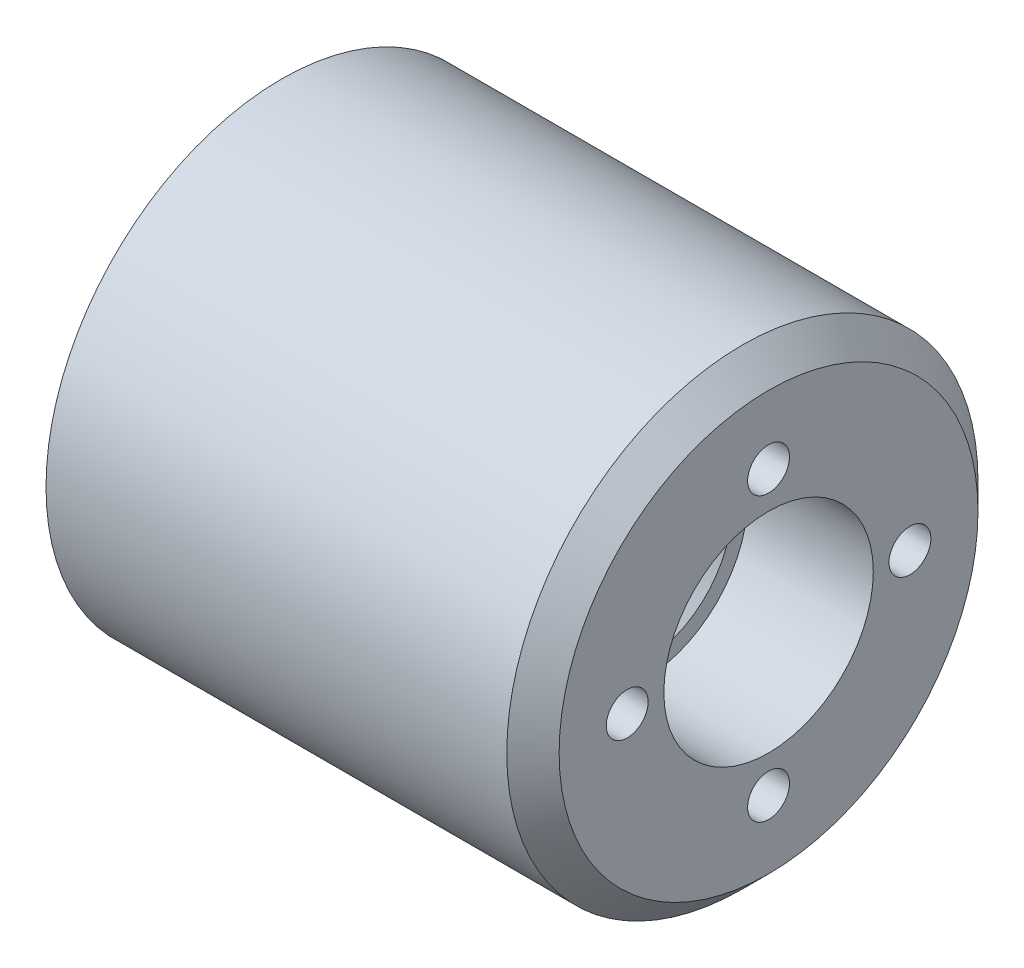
ISO-10303-21;
HEADER;
FILE_DESCRIPTION(('STEP AP214'),'2;1');
FILE_NAME('part.step','',(''),(''),'','','');
FILE_SCHEMA(('AUTOMOTIVE_DESIGN { 1 0 10303 214 1 1 1 1 }'));
ENDSEC;
DATA;
#1=APPLICATION_CONTEXT('core data for automotive mechanical design processes');
#2=APPLICATION_PROTOCOL_DEFINITION('international standard','automotive_design',2000,#1);
#3=PRODUCT_CONTEXT('',#1,'mechanical');
#4=PRODUCT('Part','Part','',(#3));
#5=PRODUCT_RELATED_PRODUCT_CATEGORY('part','',(#4));
#6=PRODUCT_DEFINITION_FORMATION('','',#4);
#7=PRODUCT_DEFINITION_CONTEXT('part definition',#1,'design');
#8=PRODUCT_DEFINITION('design','',#6,#7);
#9=PRODUCT_DEFINITION_SHAPE('','',#8);
#10=(LENGTH_UNIT() NAMED_UNIT(*) SI_UNIT(.MILLI.,.METRE.));
#11=(NAMED_UNIT(*) PLANE_ANGLE_UNIT() SI_UNIT($,.RADIAN.));
#12=(NAMED_UNIT(*) SI_UNIT($,.STERADIAN.) SOLID_ANGLE_UNIT());
#13=UNCERTAINTY_MEASURE_WITH_UNIT(LENGTH_MEASURE(1.E-05),#10,'distance_accuracy_value','');
#14=(GEOMETRIC_REPRESENTATION_CONTEXT(3) GLOBAL_UNCERTAINTY_ASSIGNED_CONTEXT((#13)) GLOBAL_UNIT_ASSIGNED_CONTEXT((#10,
#11,#12)) REPRESENTATION_CONTEXT('',''));
#15=CARTESIAN_POINT('',(0.,0.,0.));
#16=DIRECTION('',(0.,0.,1.));
#17=DIRECTION('',(1.,0.,0.));
#18=AXIS2_PLACEMENT_3D('',#15,#16,#17);
#19=CARTESIAN_POINT('',(0.,0.,0.));
#20=DIRECTION('',(-1.,0.,0.));
#21=DIRECTION('',(0.,0.,1.));
#22=AXIS2_PLACEMENT_3D('',#19,#20,#21);
#23=CYLINDRICAL_SURFACE('',#22,31.);
#24=CARTESIAN_POINT('',(48.,0.,0.));
#25=DIRECTION('',(-1.,0.,0.));
#26=DIRECTION('',(0.,0.,1.));
#27=AXIS2_PLACEMENT_3D('',#24,#25,#26);
#28=CIRCLE('',#27,31.);
#29=CARTESIAN_POINT('',(48.,0.,31.));
#30=VERTEX_POINT('',#29);
#31=EDGE_CURVE('E47',#30,#30,#28,.T.);
#32=ORIENTED_EDGE('',*,*,#31,.F.);
#33=EDGE_LOOP('',(#32));
#34=FACE_BOUND('',#33,.T.);
#35=CARTESIAN_POINT('',(0.,0.,0.));
#36=DIRECTION('',(-1.,0.,0.));
#37=DIRECTION('',(0.,0.,1.));
#38=AXIS2_PLACEMENT_3D('',#35,#36,#37);
#39=CIRCLE('',#38,31.);
#40=CARTESIAN_POINT('',(0.,0.,31.));
#41=VERTEX_POINT('',#40);
#42=EDGE_CURVE('E68',#41,#41,#39,.T.);
#43=ORIENTED_EDGE('',*,*,#42,.T.);
#44=EDGE_LOOP('',(#43));
#45=FACE_BOUND('',#44,.T.);
#46=ADVANCED_FACE('F28',(#34,#45),#23,.F.);
#47=CARTESIAN_POINT('',(48.,27.,0.));
#48=DIRECTION('',(1.,0.,0.));
#49=DIRECTION('',(0.,0.,-1.));
#50=AXIS2_PLACEMENT_3D('',#47,#48,#49);
#51=PLANE('',#50);
#52=CARTESIAN_POINT('',(48.,0.,0.));
#53=DIRECTION('',(-1.,0.,0.));
#54=DIRECTION('',(0.,0.,1.));
#55=AXIS2_PLACEMENT_3D('',#52,#53,#54);
#56=CIRCLE('',#55,27.);
#57=CARTESIAN_POINT('',(48.,0.,27.));
#58=VERTEX_POINT('',#57);
#59=EDGE_CURVE('E50',#58,#58,#56,.T.);
#60=ORIENTED_EDGE('',*,*,#59,.F.);
#61=EDGE_LOOP('',(#60));
#62=FACE_BOUND('',#61,.T.);
#63=ORIENTED_EDGE('',*,*,#31,.T.);
#64=EDGE_LOOP('',(#63));
#65=FACE_BOUND('',#64,.T.);
#66=ADVANCED_FACE('F166',(#62,#65),#51,.F.);
#67=CARTESIAN_POINT('',(0.,0.,0.));
#68=DIRECTION('',(-1.,0.,0.));
#69=DIRECTION('',(0.,0.,1.));
#70=AXIS2_PLACEMENT_3D('',#67,#68,#69);
#71=CYLINDRICAL_SURFACE('',#70,27.);
#72=CARTESIAN_POINT('',(61.,0.,0.));
#73=DIRECTION('',(-1.,0.,0.));
#74=DIRECTION('',(0.,0.,1.));
#75=AXIS2_PLACEMENT_3D('',#72,#73,#74);
#76=CIRCLE('',#75,27.);
#77=CARTESIAN_POINT('',(61.,0.,27.));
#78=VERTEX_POINT('',#77);
#79=EDGE_CURVE('E53',#78,#78,#76,.T.);
#80=ORIENTED_EDGE('',*,*,#79,.F.);
#81=EDGE_LOOP('',(#80));
#82=FACE_BOUND('',#81,.T.);
#83=ORIENTED_EDGE('',*,*,#59,.T.);
#84=EDGE_LOOP('',(#83));
#85=FACE_BOUND('',#84,.T.);
#86=ADVANCED_FACE('F171',(#82,#85),#71,.F.);
#87=CARTESIAN_POINT('',(61.,13.,0.));
#88=DIRECTION('',(1.,0.,0.));
#89=DIRECTION('',(0.,0.,-1.));
#90=AXIS2_PLACEMENT_3D('',#87,#88,#89);
#91=PLANE('',#90);
#92=CARTESIAN_POINT('',(61.,0.,0.));
#93=DIRECTION('',(-1.,0.,0.));
#94=DIRECTION('',(0.,0.,1.));
#95=AXIS2_PLACEMENT_3D('',#92,#93,#94);
#96=CIRCLE('',#95,13.);
#97=CARTESIAN_POINT('',(61.,0.,13.));
#98=VERTEX_POINT('',#97);
#99=EDGE_CURVE('E56',#98,#98,#96,.T.);
#100=ORIENTED_EDGE('',*,*,#99,.F.);
#101=EDGE_LOOP('',(#100));
#102=FACE_BOUND('',#101,.T.);
#103=ORIENTED_EDGE('',*,*,#79,.T.);
#104=EDGE_LOOP('',(#103));
#105=FACE_BOUND('',#104,.T.);
#106=ADVANCED_FACE('F163',(#102,#105),#91,.F.);
#107=CARTESIAN_POINT('',(0.,0.,0.));
#108=DIRECTION('',(-1.,0.,0.));
#109=DIRECTION('',(0.,0.,1.));
#110=AXIS2_PLACEMENT_3D('',#107,#108,#109);
#111=CYLINDRICAL_SURFACE('',#110,13.);
#112=CARTESIAN_POINT('',(65.,0.,0.));
#113=DIRECTION('',(-1.,0.,0.));
#114=DIRECTION('',(0.,0.,1.));
#115=AXIS2_PLACEMENT_3D('',#112,#113,#114);
#116=CIRCLE('',#115,13.);
#117=CARTESIAN_POINT('',(65.,0.,13.));
#118=VERTEX_POINT('',#117);
#119=EDGE_CURVE('E10',#118,#118,#116,.F.);
#120=ORIENTED_EDGE('',*,*,#119,.T.);
#121=EDGE_LOOP('',(#120));
#122=FACE_BOUND('',#121,.T.);
#123=ORIENTED_EDGE('',*,*,#99,.T.);
#124=EDGE_LOOP('',(#123));
#125=FACE_BOUND('',#124,.T.);
#126=ADVANCED_FACE('F157',(#122,#125),#111,.F.);
#127=CARTESIAN_POINT('',(69.,20.,0.));
#128=DIRECTION('',(-1.,0.,0.));
#129=DIRECTION('',(0.,0.,1.));
#130=AXIS2_PLACEMENT_3D('',#127,#128,#129);
#131=PLANE('',#130);
#132=CARTESIAN_POINT('',(69.,0.,0.));
#133=DIRECTION('',(-1.,0.,0.));
#134=DIRECTION('',(0.,0.,1.));
#135=AXIS2_PLACEMENT_3D('',#132,#133,#134);
#136=CIRCLE('',#135,17.);
#137=CARTESIAN_POINT('',(69.,0.,17.));
#138=VERTEX_POINT('',#137);
#139=EDGE_CURVE('E34',#138,#138,#136,.T.);
#140=ORIENTED_EDGE('',*,*,#139,.T.);
#141=EDGE_LOOP('',(#140));
#142=FACE_BOUND('',#141,.T.);
#143=CARTESIAN_POINT('',(69.,0.,0.));
#144=DIRECTION('',(-1.,0.,0.));
#145=DIRECTION('',(0.,0.,1.));
#146=AXIS2_PLACEMENT_3D('',#143,#144,#145);
#147=CIRCLE('',#146,20.);
#148=CARTESIAN_POINT('',(69.,0.,20.));
#149=VERTEX_POINT('',#148);
#150=EDGE_CURVE('E59',#149,#149,#147,.T.);
#151=ORIENTED_EDGE('',*,*,#150,.F.);
#152=EDGE_LOOP('',(#151));
#153=FACE_BOUND('',#152,.T.);
#154=ADVANCED_FACE('F152',(#142,#153),#131,.F.);
#155=CARTESIAN_POINT('',(0.,0.,0.));
#156=DIRECTION('',(-1.,0.,0.));
#157=DIRECTION('',(0.,0.,1.));
#158=AXIS2_PLACEMENT_3D('',#155,#156,#157);
#159=CYLINDRICAL_SURFACE('',#158,20.);
#160=CARTESIAN_POINT('',(93.,0.,0.));
#161=DIRECTION('',(-1.,0.,0.));
#162=DIRECTION('',(0.,0.,1.));
#163=AXIS2_PLACEMENT_3D('',#160,#161,#162);
#164=CIRCLE('',#163,20.);
#165=CARTESIAN_POINT('',(93.,0.,20.));
#166=VERTEX_POINT('',#165);
#167=EDGE_CURVE('E62',#166,#166,#164,.T.);
#168=ORIENTED_EDGE('',*,*,#167,.F.);
#169=EDGE_LOOP('',(#168));
#170=FACE_BOUND('',#169,.T.);
#171=ORIENTED_EDGE('',*,*,#150,.T.);
#172=EDGE_LOOP('',(#171));
#173=FACE_BOUND('',#172,.T.);
#174=ADVANCED_FACE('F138',(#170,#173),#159,.F.);
#175=CARTESIAN_POINT('',(93.,45.,0.));
#176=DIRECTION('',(-1.,0.,0.));
#177=DIRECTION('',(0.,0.,1.));
#178=AXIS2_PLACEMENT_3D('',#175,#176,#177);
#179=PLANE('',#178);
#180=CARTESIAN_POINT('',(93.,2.8281015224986E-13,-27.));
#181=DIRECTION('',(1.,0.,0.));
#182=DIRECTION('',(0.,-1.,0.));
#183=AXIS2_PLACEMENT_3D('',#180,#181,#182);
#184=CIRCLE('',#183,4.);
#185=CARTESIAN_POINT('',(93.,-3.99999999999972,-27.));
#186=VERTEX_POINT('',#185);
#187=EDGE_CURVE('E128',#186,#186,#184,.T.);
#188=ORIENTED_EDGE('',*,*,#187,.F.);
#189=EDGE_LOOP('',(#188));
#190=FACE_BOUND('',#189,.T.);
#191=CARTESIAN_POINT('',(93.,-27.,-1.88540101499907E-13));
#192=DIRECTION('',(1.,0.,0.));
#193=DIRECTION('',(0.,0.,1.));
#194=AXIS2_PLACEMENT_3D('',#191,#192,#193);
#195=CIRCLE('',#194,4.);
#196=CARTESIAN_POINT('',(93.,-27.,3.99999999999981));
#197=VERTEX_POINT('',#196);
#198=EDGE_CURVE('E122',#197,#197,#195,.T.);
#199=ORIENTED_EDGE('',*,*,#198,.F.);
#200=EDGE_LOOP('',(#199));
#201=FACE_BOUND('',#200,.T.);
#202=CARTESIAN_POINT('',(93.,0.,27.));
#203=DIRECTION('',(1.,0.,0.));
#204=DIRECTION('',(0.,1.,0.));
#205=AXIS2_PLACEMENT_3D('',#202,#203,#204);
#206=CIRCLE('',#205,4.);
#207=CARTESIAN_POINT('',(93.,3.99999999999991,27.));
#208=VERTEX_POINT('',#207);
#209=EDGE_CURVE('E116',#208,#208,#206,.T.);
#210=ORIENTED_EDGE('',*,*,#209,.F.);
#211=EDGE_LOOP('',(#210));
#212=FACE_BOUND('',#211,.T.);
#213=CARTESIAN_POINT('',(93.,27.,0.));
#214=DIRECTION('',(1.,0.,0.));
#215=DIRECTION('',(0.,0.,-1.));
#216=AXIS2_PLACEMENT_3D('',#213,#214,#215);
#217=CIRCLE('',#216,4.);
#218=CARTESIAN_POINT('',(93.,27.,-4.));
#219=VERTEX_POINT('',#218);
#220=EDGE_CURVE('E110',#219,#219,#217,.T.);
#221=ORIENTED_EDGE('',*,*,#220,.F.);
#222=EDGE_LOOP('',(#221));
#223=FACE_BOUND('',#222,.T.);
#224=CARTESIAN_POINT('',(93.,0.,0.));
#225=DIRECTION('',(-1.,0.,0.));
#226=DIRECTION('',(0.,0.,1.));
#227=AXIS2_PLACEMENT_3D('',#224,#225,#226);
#228=CIRCLE('',#227,40.);
#229=CARTESIAN_POINT('',(93.,0.,40.));
#230=VERTEX_POINT('',#229);
#231=EDGE_CURVE('E38',#230,#230,#228,.F.);
#232=ORIENTED_EDGE('',*,*,#231,.T.);
#233=EDGE_LOOP('',(#232));
#234=FACE_BOUND('',#233,.T.);
#235=ORIENTED_EDGE('',*,*,#167,.T.);
#236=EDGE_LOOP('',(#235));
#237=FACE_BOUND('',#236,.T.);
#238=ADVANCED_FACE('F134',(#190,#201,#212,#223,#234,#237),#179,.F.);
#239=CARTESIAN_POINT('',(0.,0.,0.));
#240=DIRECTION('',(-1.,0.,0.));
#241=DIRECTION('',(0.,0.,1.));
#242=AXIS2_PLACEMENT_3D('',#239,#240,#241);
#243=CYLINDRICAL_SURFACE('',#242,45.);
#244=CARTESIAN_POINT('',(88.,0.,0.));
#245=DIRECTION('',(-1.,0.,0.));
#246=DIRECTION('',(0.,0.,1.));
#247=AXIS2_PLACEMENT_3D('',#244,#245,#246);
#248=CIRCLE('',#247,45.);
#249=CARTESIAN_POINT('',(88.,0.,45.));
#250=VERTEX_POINT('',#249);
#251=EDGE_CURVE('E42',#250,#250,#248,.T.);
#252=ORIENTED_EDGE('',*,*,#251,.T.);
#253=EDGE_LOOP('',(#252));
#254=FACE_BOUND('',#253,.T.);
#255=CARTESIAN_POINT('',(0.,0.,0.));
#256=DIRECTION('',(-1.,0.,0.));
#257=DIRECTION('',(0.,0.,1.));
#258=AXIS2_PLACEMENT_3D('',#255,#256,#257);
#259=CIRCLE('',#258,45.);
#260=CARTESIAN_POINT('',(0.,0.,45.));
#261=VERTEX_POINT('',#260);
#262=EDGE_CURVE('E65',#261,#261,#259,.T.);
#263=ORIENTED_EDGE('',*,*,#262,.F.);
#264=EDGE_LOOP('',(#263));
#265=FACE_BOUND('',#264,.T.);
#266=ADVANCED_FACE('F137',(#254,#265),#243,.T.);
#267=CARTESIAN_POINT('',(0.,31.,0.));
#268=DIRECTION('',(1.,0.,0.));
#269=DIRECTION('',(0.,0.,-1.));
#270=AXIS2_PLACEMENT_3D('',#267,#268,#269);
#271=PLANE('',#270);
#272=CARTESIAN_POINT('',(0.,18.7500000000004,-32.4759526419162));
#273=DIRECTION('',(-1.,0.,0.));
#274=DIRECTION('',(0.,0.866025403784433,0.50000000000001));
#275=AXIS2_PLACEMENT_3D('',#272,#273,#274);
#276=CIRCLE('',#275,4.);
#277=CARTESIAN_POINT('',(0.,22.2141016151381,-30.4759526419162));
#278=VERTEX_POINT('',#277);
#279=EDGE_CURVE('E104',#278,#278,#276,.T.);
#280=ORIENTED_EDGE('',*,*,#279,.F.);
#281=EDGE_LOOP('',(#280));
#282=FACE_BOUND('',#281,.T.);
#283=CARTESIAN_POINT('',(0.,-18.7499999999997,-32.4759526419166));
#284=DIRECTION('',(-1.,0.,0.));
#285=DIRECTION('',(0.,0.866025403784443,-0.499999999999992));
#286=AXIS2_PLACEMENT_3D('',#283,#284,#285);
#287=CIRCLE('',#286,4.);
#288=CARTESIAN_POINT('',(0.,-15.2858983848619,-34.4759526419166));
#289=VERTEX_POINT('',#288);
#290=EDGE_CURVE('E98',#289,#289,#287,.T.);
#291=ORIENTED_EDGE('',*,*,#290,.F.);
#292=EDGE_LOOP('',(#291));
#293=FACE_BOUND('',#292,.T.);
#294=CARTESIAN_POINT('',(0.,-37.5,-2.61861252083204E-13));
#295=DIRECTION('',(-1.,0.,0.));
#296=DIRECTION('',(0.,0.,-1.));
#297=AXIS2_PLACEMENT_3D('',#294,#295,#296);
#298=CIRCLE('',#297,4.);
#299=CARTESIAN_POINT('',(0.,-37.5,-4.00000000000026));
#300=VERTEX_POINT('',#299);
#301=EDGE_CURVE('E92',#300,#300,#298,.T.);
#302=ORIENTED_EDGE('',*,*,#301,.F.);
#303=EDGE_LOOP('',(#302));
#304=FACE_BOUND('',#303,.T.);
#305=CARTESIAN_POINT('',(0.,-18.7500000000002,32.4759526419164));
#306=DIRECTION('',(-1.,0.,0.));
#307=DIRECTION('',(0.,-0.866025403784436,-0.500000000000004));
#308=AXIS2_PLACEMENT_3D('',#305,#306,#307);
#309=CIRCLE('',#308,4.);
#310=CARTESIAN_POINT('',(0.,-22.2141016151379,30.4759526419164));
#311=VERTEX_POINT('',#310);
#312=EDGE_CURVE('E86',#311,#311,#309,.T.);
#313=ORIENTED_EDGE('',*,*,#312,.F.);
#314=EDGE_LOOP('',(#313));
#315=FACE_BOUND('',#314,.T.);
#316=CARTESIAN_POINT('',(0.,18.7499999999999,32.4759526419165));
#317=DIRECTION('',(-1.,0.,0.));
#318=DIRECTION('',(0.,-0.86602540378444,0.499999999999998));
#319=AXIS2_PLACEMENT_3D('',#316,#317,#318);
#320=CIRCLE('',#319,4.);
#321=CARTESIAN_POINT('',(0.,15.2858983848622,34.4759526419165));
#322=VERTEX_POINT('',#321);
#323=EDGE_CURVE('E80',#322,#322,#320,.T.);
#324=ORIENTED_EDGE('',*,*,#323,.F.);
#325=EDGE_LOOP('',(#324));
#326=FACE_BOUND('',#325,.T.);
#327=CARTESIAN_POINT('',(0.,37.5,0.));
#328=DIRECTION('',(-1.,0.,0.));
#329=DIRECTION('',(0.,0.,1.));
#330=AXIS2_PLACEMENT_3D('',#327,#328,#329);
#331=CIRCLE('',#330,4.);
#332=CARTESIAN_POINT('',(0.,37.5,4.));
#333=VERTEX_POINT('',#332);
#334=EDGE_CURVE('E74',#333,#333,#331,.T.);
#335=ORIENTED_EDGE('',*,*,#334,.F.);
#336=EDGE_LOOP('',(#335));
#337=FACE_BOUND('',#336,.T.);
#338=ORIENTED_EDGE('',*,*,#42,.F.);
#339=EDGE_LOOP('',(#338));
#340=FACE_BOUND('',#339,.T.);
#341=ORIENTED_EDGE('',*,*,#262,.T.);
#342=EDGE_LOOP('',(#341));
#343=FACE_BOUND('',#342,.T.);
#344=ADVANCED_FACE('F177',(#282,#293,#304,#315,#326,#337,#340,#343),#271,.F.);
#345=CARTESIAN_POINT('',(88.,0.,0.));
#346=DIRECTION('',(-1.,0.,0.));
#347=DIRECTION('',(0.,0.,1.));
#348=AXIS2_PLACEMENT_3D('',#345,#346,#347);
#349=CONICAL_SURFACE('',#348,45.,0.785398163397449);
#350=ORIENTED_EDGE('',*,*,#231,.F.);
#351=EDGE_LOOP('',(#350));
#352=FACE_BOUND('',#351,.T.);
#353=ORIENTED_EDGE('',*,*,#251,.F.);
#354=EDGE_LOOP('',(#353));
#355=FACE_BOUND('',#354,.T.);
#356=ADVANCED_FACE('F180',(#352,#355),#349,.T.);
#357=CARTESIAN_POINT('',(69.,0.,0.));
#358=DIRECTION('',(1.,0.,0.));
#359=DIRECTION('',(0.,0.,-1.));
#360=AXIS2_PLACEMENT_3D('',#357,#358,#359);
#361=CONICAL_SURFACE('',#360,17.,0.785398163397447);
#362=ORIENTED_EDGE('',*,*,#119,.F.);
#363=EDGE_LOOP('',(#362));
#364=FACE_BOUND('',#363,.T.);
#365=ORIENTED_EDGE('',*,*,#139,.F.);
#366=EDGE_LOOP('',(#365));
#367=FACE_BOUND('',#366,.T.);
#368=ADVANCED_FACE('F193',(#364,#367),#361,.F.);
#369=CARTESIAN_POINT('',(15.,37.5,0.));
#370=DIRECTION('',(-1.,0.,0.));
#371=DIRECTION('',(0.,0.,1.));
#372=AXIS2_PLACEMENT_3D('',#369,#370,#371);
#373=CYLINDRICAL_SURFACE('',#372,4.);
#374=CARTESIAN_POINT('',(15.,37.5,0.));
#375=DIRECTION('',(-1.,0.,0.));
#376=DIRECTION('',(0.,0.,1.));
#377=AXIS2_PLACEMENT_3D('',#374,#375,#376);
#378=CIRCLE('',#377,4.);
#379=CARTESIAN_POINT('',(15.,37.5,4.));
#380=VERTEX_POINT('',#379);
#381=EDGE_CURVE('E71',#380,#380,#378,.T.);
#382=ORIENTED_EDGE('',*,*,#381,.F.);
#383=EDGE_LOOP('',(#382));
#384=FACE_BOUND('',#383,.T.);
#385=ORIENTED_EDGE('',*,*,#334,.T.);
#386=EDGE_LOOP('',(#385));
#387=FACE_BOUND('',#386,.T.);
#388=ADVANCED_FACE('F196',(#384,#387),#373,.F.);
#389=CARTESIAN_POINT('',(15.,37.5,0.));
#390=DIRECTION('',(-1.,0.,0.));
#391=DIRECTION('',(0.,0.,1.));
#392=AXIS2_PLACEMENT_3D('',#389,#390,#391);
#393=PLANE('',#392);
#394=ORIENTED_EDGE('',*,*,#381,.T.);
#395=EDGE_LOOP('',(#394));
#396=FACE_BOUND('',#395,.T.);
#397=ADVANCED_FACE('F200',(#396),#393,.T.);
#398=CARTESIAN_POINT('',(15.,18.7499999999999,32.4759526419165));
#399=DIRECTION('',(-1.,0.,0.));
#400=DIRECTION('',(0.,0.,1.));
#401=AXIS2_PLACEMENT_3D('',#398,#399,#400);
#402=CYLINDRICAL_SURFACE('',#401,4.);
#403=CARTESIAN_POINT('',(15.,18.7499999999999,32.4759526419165));
#404=DIRECTION('',(-1.,0.,0.));
#405=DIRECTION('',(0.,-0.86602540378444,0.499999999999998));
#406=AXIS2_PLACEMENT_3D('',#403,#404,#405);
#407=CIRCLE('',#406,4.);
#408=CARTESIAN_POINT('',(15.,15.2858983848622,34.4759526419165));
#409=VERTEX_POINT('',#408);
#410=EDGE_CURVE('E77',#409,#409,#407,.T.);
#411=ORIENTED_EDGE('',*,*,#410,.F.);
#412=EDGE_LOOP('',(#411));
#413=FACE_BOUND('',#412,.T.);
#414=ORIENTED_EDGE('',*,*,#323,.T.);
#415=EDGE_LOOP('',(#414));
#416=FACE_BOUND('',#415,.T.);
#417=ADVANCED_FACE('F204',(#413,#416),#402,.F.);
#418=CARTESIAN_POINT('',(15.,18.7499999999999,32.4759526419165));
#419=DIRECTION('',(-1.,0.,0.));
#420=DIRECTION('',(0.,-0.86602540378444,0.499999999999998));
#421=AXIS2_PLACEMENT_3D('',#418,#419,#420);
#422=PLANE('',#421);
#423=ORIENTED_EDGE('',*,*,#410,.T.);
#424=EDGE_LOOP('',(#423));
#425=FACE_BOUND('',#424,.T.);
#426=ADVANCED_FACE('F208',(#425),#422,.T.);
#427=CARTESIAN_POINT('',(15.,-18.7500000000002,32.4759526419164));
#428=DIRECTION('',(-1.,0.,0.));
#429=DIRECTION('',(0.,0.,1.));
#430=AXIS2_PLACEMENT_3D('',#427,#428,#429);
#431=CYLINDRICAL_SURFACE('',#430,4.);
#432=CARTESIAN_POINT('',(15.,-18.7500000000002,32.4759526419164));
#433=DIRECTION('',(-1.,0.,0.));
#434=DIRECTION('',(0.,-0.866025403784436,-0.500000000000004));
#435=AXIS2_PLACEMENT_3D('',#432,#433,#434);
#436=CIRCLE('',#435,4.);
#437=CARTESIAN_POINT('',(15.,-22.2141016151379,30.4759526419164));
#438=VERTEX_POINT('',#437);
#439=EDGE_CURVE('E83',#438,#438,#436,.T.);
#440=ORIENTED_EDGE('',*,*,#439,.F.);
#441=EDGE_LOOP('',(#440));
#442=FACE_BOUND('',#441,.T.);
#443=ORIENTED_EDGE('',*,*,#312,.T.);
#444=EDGE_LOOP('',(#443));
#445=FACE_BOUND('',#444,.T.);
#446=ADVANCED_FACE('F212',(#442,#445),#431,.F.);
#447=CARTESIAN_POINT('',(15.,-18.7500000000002,32.4759526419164));
#448=DIRECTION('',(-1.,0.,0.));
#449=DIRECTION('',(0.,-0.866025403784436,-0.500000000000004));
#450=AXIS2_PLACEMENT_3D('',#447,#448,#449);
#451=PLANE('',#450);
#452=ORIENTED_EDGE('',*,*,#439,.T.);
#453=EDGE_LOOP('',(#452));
#454=FACE_BOUND('',#453,.T.);
#455=ADVANCED_FACE('F216',(#454),#451,.T.);
#456=CARTESIAN_POINT('',(15.,-37.5,-2.61861252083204E-13));
#457=DIRECTION('',(-1.,0.,0.));
#458=DIRECTION('',(0.,0.,1.));
#459=AXIS2_PLACEMENT_3D('',#456,#457,#458);
#460=CYLINDRICAL_SURFACE('',#459,4.);
#461=CARTESIAN_POINT('',(15.,-37.5,-2.61861252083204E-13));
#462=DIRECTION('',(-1.,0.,0.));
#463=DIRECTION('',(0.,0.,-1.));
#464=AXIS2_PLACEMENT_3D('',#461,#462,#463);
#465=CIRCLE('',#464,4.);
#466=CARTESIAN_POINT('',(15.,-37.5,-4.00000000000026));
#467=VERTEX_POINT('',#466);
#468=EDGE_CURVE('E89',#467,#467,#465,.T.);
#469=ORIENTED_EDGE('',*,*,#468,.F.);
#470=EDGE_LOOP('',(#469));
#471=FACE_BOUND('',#470,.T.);
#472=ORIENTED_EDGE('',*,*,#301,.T.);
#473=EDGE_LOOP('',(#472));
#474=FACE_BOUND('',#473,.T.);
#475=ADVANCED_FACE('F220',(#471,#474),#460,.F.);
#476=CARTESIAN_POINT('',(15.,-37.5,-2.61861252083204E-13));
#477=DIRECTION('',(-1.,0.,0.));
#478=DIRECTION('',(0.,0.,-1.));
#479=AXIS2_PLACEMENT_3D('',#476,#477,#478);
#480=PLANE('',#479);
#481=ORIENTED_EDGE('',*,*,#468,.T.);
#482=EDGE_LOOP('',(#481));
#483=FACE_BOUND('',#482,.T.);
#484=ADVANCED_FACE('F224',(#483),#480,.T.);
#485=CARTESIAN_POINT('',(15.,-18.7499999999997,-32.4759526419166));
#486=DIRECTION('',(-1.,0.,0.));
#487=DIRECTION('',(0.,0.,1.));
#488=AXIS2_PLACEMENT_3D('',#485,#486,#487);
#489=CYLINDRICAL_SURFACE('',#488,4.);
#490=CARTESIAN_POINT('',(15.,-18.7499999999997,-32.4759526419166));
#491=DIRECTION('',(-1.,0.,0.));
#492=DIRECTION('',(0.,0.866025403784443,-0.499999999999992));
#493=AXIS2_PLACEMENT_3D('',#490,#491,#492);
#494=CIRCLE('',#493,4.);
#495=CARTESIAN_POINT('',(15.,-15.2858983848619,-34.4759526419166));
#496=VERTEX_POINT('',#495);
#497=EDGE_CURVE('E95',#496,#496,#494,.T.);
#498=ORIENTED_EDGE('',*,*,#497,.F.);
#499=EDGE_LOOP('',(#498));
#500=FACE_BOUND('',#499,.T.);
#501=ORIENTED_EDGE('',*,*,#290,.T.);
#502=EDGE_LOOP('',(#501));
#503=FACE_BOUND('',#502,.T.);
#504=ADVANCED_FACE('F228',(#500,#503),#489,.F.);
#505=CARTESIAN_POINT('',(15.,-18.7499999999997,-32.4759526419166));
#506=DIRECTION('',(-1.,0.,0.));
#507=DIRECTION('',(0.,0.866025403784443,-0.499999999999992));
#508=AXIS2_PLACEMENT_3D('',#505,#506,#507);
#509=PLANE('',#508);
#510=ORIENTED_EDGE('',*,*,#497,.T.);
#511=EDGE_LOOP('',(#510));
#512=FACE_BOUND('',#511,.T.);
#513=ADVANCED_FACE('F232',(#512),#509,.T.);
#514=CARTESIAN_POINT('',(15.,18.7500000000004,-32.4759526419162));
#515=DIRECTION('',(-1.,0.,0.));
#516=DIRECTION('',(0.,0.,1.));
#517=AXIS2_PLACEMENT_3D('',#514,#515,#516);
#518=CYLINDRICAL_SURFACE('',#517,4.);
#519=CARTESIAN_POINT('',(15.,18.7500000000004,-32.4759526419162));
#520=DIRECTION('',(-1.,0.,0.));
#521=DIRECTION('',(0.,0.866025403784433,0.50000000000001));
#522=AXIS2_PLACEMENT_3D('',#519,#520,#521);
#523=CIRCLE('',#522,4.);
#524=CARTESIAN_POINT('',(15.,22.2141016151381,-30.4759526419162));
#525=VERTEX_POINT('',#524);
#526=EDGE_CURVE('E101',#525,#525,#523,.T.);
#527=ORIENTED_EDGE('',*,*,#526,.F.);
#528=EDGE_LOOP('',(#527));
#529=FACE_BOUND('',#528,.T.);
#530=ORIENTED_EDGE('',*,*,#279,.T.);
#531=EDGE_LOOP('',(#530));
#532=FACE_BOUND('',#531,.T.);
#533=ADVANCED_FACE('F236',(#529,#532),#518,.F.);
#534=CARTESIAN_POINT('',(15.,18.7500000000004,-32.4759526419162));
#535=DIRECTION('',(-1.,0.,0.));
#536=DIRECTION('',(0.,0.866025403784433,0.50000000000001));
#537=AXIS2_PLACEMENT_3D('',#534,#535,#536);
#538=PLANE('',#537);
#539=ORIENTED_EDGE('',*,*,#526,.T.);
#540=EDGE_LOOP('',(#539));
#541=FACE_BOUND('',#540,.T.);
#542=ADVANCED_FACE('F240',(#541),#538,.T.);
#543=CARTESIAN_POINT('',(78.,27.,0.));
#544=DIRECTION('',(1.,0.,0.));
#545=DIRECTION('',(0.,0.,-1.));
#546=AXIS2_PLACEMENT_3D('',#543,#544,#545);
#547=CYLINDRICAL_SURFACE('',#546,4.);
#548=CARTESIAN_POINT('',(78.,27.,0.));
#549=DIRECTION('',(1.,0.,0.));
#550=DIRECTION('',(0.,0.,-1.));
#551=AXIS2_PLACEMENT_3D('',#548,#549,#550);
#552=CIRCLE('',#551,4.);
#553=CARTESIAN_POINT('',(78.,27.,-4.));
#554=VERTEX_POINT('',#553);
#555=EDGE_CURVE('E107',#554,#554,#552,.T.);
#556=ORIENTED_EDGE('',*,*,#555,.F.);
#557=EDGE_LOOP('',(#556));
#558=FACE_BOUND('',#557,.T.);
#559=ORIENTED_EDGE('',*,*,#220,.T.);
#560=EDGE_LOOP('',(#559));
#561=FACE_BOUND('',#560,.T.);
#562=ADVANCED_FACE('F244',(#558,#561),#547,.F.);
#563=CARTESIAN_POINT('',(78.,27.,0.));
#564=DIRECTION('',(1.,0.,0.));
#565=DIRECTION('',(0.,0.,-1.));
#566=AXIS2_PLACEMENT_3D('',#563,#564,#565);
#567=PLANE('',#566);
#568=ORIENTED_EDGE('',*,*,#555,.T.);
#569=EDGE_LOOP('',(#568));
#570=FACE_BOUND('',#569,.T.);
#571=ADVANCED_FACE('F248',(#570),#567,.T.);
#572=CARTESIAN_POINT('',(78.,0.,27.));
#573=DIRECTION('',(1.,0.,0.));
#574=DIRECTION('',(0.,0.,-1.));
#575=AXIS2_PLACEMENT_3D('',#572,#573,#574);
#576=CYLINDRICAL_SURFACE('',#575,4.);
#577=CARTESIAN_POINT('',(78.,0.,27.));
#578=DIRECTION('',(1.,0.,0.));
#579=DIRECTION('',(0.,1.,0.));
#580=AXIS2_PLACEMENT_3D('',#577,#578,#579);
#581=CIRCLE('',#580,4.);
#582=CARTESIAN_POINT('',(78.,3.99999999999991,27.));
#583=VERTEX_POINT('',#582);
#584=EDGE_CURVE('E113',#583,#583,#581,.T.);
#585=ORIENTED_EDGE('',*,*,#584,.F.);
#586=EDGE_LOOP('',(#585));
#587=FACE_BOUND('',#586,.T.);
#588=ORIENTED_EDGE('',*,*,#209,.T.);
#589=EDGE_LOOP('',(#588));
#590=FACE_BOUND('',#589,.T.);
#591=ADVANCED_FACE('F252',(#587,#590),#576,.F.);
#592=CARTESIAN_POINT('',(78.,0.,27.));
#593=DIRECTION('',(1.,0.,0.));
#594=DIRECTION('',(0.,1.,0.));
#595=AXIS2_PLACEMENT_3D('',#592,#593,#594);
#596=PLANE('',#595);
#597=ORIENTED_EDGE('',*,*,#584,.T.);
#598=EDGE_LOOP('',(#597));
#599=FACE_BOUND('',#598,.T.);
#600=ADVANCED_FACE('F256',(#599),#596,.T.);
#601=CARTESIAN_POINT('',(78.,-27.,-1.88540101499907E-13));
#602=DIRECTION('',(1.,0.,0.));
#603=DIRECTION('',(0.,0.,-1.));
#604=AXIS2_PLACEMENT_3D('',#601,#602,#603);
#605=CYLINDRICAL_SURFACE('',#604,4.);
#606=CARTESIAN_POINT('',(78.,-27.,-1.88540101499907E-13));
#607=DIRECTION('',(1.,0.,0.));
#608=DIRECTION('',(0.,0.,1.));
#609=AXIS2_PLACEMENT_3D('',#606,#607,#608);
#610=CIRCLE('',#609,4.);
#611=CARTESIAN_POINT('',(78.,-27.,3.99999999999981));
#612=VERTEX_POINT('',#611);
#613=EDGE_CURVE('E119',#612,#612,#610,.T.);
#614=ORIENTED_EDGE('',*,*,#613,.F.);
#615=EDGE_LOOP('',(#614));
#616=FACE_BOUND('',#615,.T.);
#617=ORIENTED_EDGE('',*,*,#198,.T.);
#618=EDGE_LOOP('',(#617));
#619=FACE_BOUND('',#618,.T.);
#620=ADVANCED_FACE('F260',(#616,#619),#605,.F.);
#621=CARTESIAN_POINT('',(78.,-27.,-1.88540101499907E-13));
#622=DIRECTION('',(1.,0.,0.));
#623=DIRECTION('',(0.,0.,1.));
#624=AXIS2_PLACEMENT_3D('',#621,#622,#623);
#625=PLANE('',#624);
#626=ORIENTED_EDGE('',*,*,#613,.T.);
#627=EDGE_LOOP('',(#626));
#628=FACE_BOUND('',#627,.T.);
#629=ADVANCED_FACE('F264',(#628),#625,.T.);
#630=CARTESIAN_POINT('',(78.,2.8281015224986E-13,-27.));
#631=DIRECTION('',(1.,0.,0.));
#632=DIRECTION('',(0.,0.,-1.));
#633=AXIS2_PLACEMENT_3D('',#630,#631,#632);
#634=CYLINDRICAL_SURFACE('',#633,4.);
#635=CARTESIAN_POINT('',(78.,2.8281015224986E-13,-27.));
#636=DIRECTION('',(1.,0.,0.));
#637=DIRECTION('',(0.,-1.,0.));
#638=AXIS2_PLACEMENT_3D('',#635,#636,#637);
#639=CIRCLE('',#638,4.);
#640=CARTESIAN_POINT('',(78.,-3.99999999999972,-27.));
#641=VERTEX_POINT('',#640);
#642=EDGE_CURVE('E125',#641,#641,#639,.T.);
#643=ORIENTED_EDGE('',*,*,#642,.F.);
#644=EDGE_LOOP('',(#643));
#645=FACE_BOUND('',#644,.T.);
#646=ORIENTED_EDGE('',*,*,#187,.T.);
#647=EDGE_LOOP('',(#646));
#648=FACE_BOUND('',#647,.T.);
#649=ADVANCED_FACE('F132',(#645,#648),#634,.F.);
#650=CARTESIAN_POINT('',(78.,2.8281015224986E-13,-27.));
#651=DIRECTION('',(1.,0.,0.));
#652=DIRECTION('',(0.,-1.,0.));
#653=AXIS2_PLACEMENT_3D('',#650,#651,#652);
#654=PLANE('',#653);
#655=ORIENTED_EDGE('',*,*,#642,.T.);
#656=EDGE_LOOP('',(#655));
#657=FACE_BOUND('',#656,.T.);
#658=ADVANCED_FACE('F271',(#657),#654,.T.);
#659=CLOSED_SHELL('',(#46,#66,#86,#106,#126,#154,#174,#238,#266,#344,#356,#368,#388,#397,#417,
#426,#446,#455,#475,#484,#504,#513,#533,#542,#562,#571,#591,#600,#620,#629,#649,#658));
#660=MANIFOLD_SOLID_BREP('B2',#659);
#661=ADVANCED_BREP_SHAPE_REPRESENTATION('',(#18,#660),#14);
#662=SHAPE_DEFINITION_REPRESENTATION(#9,#661);
ENDSEC;
END-ISO-10303-21;
